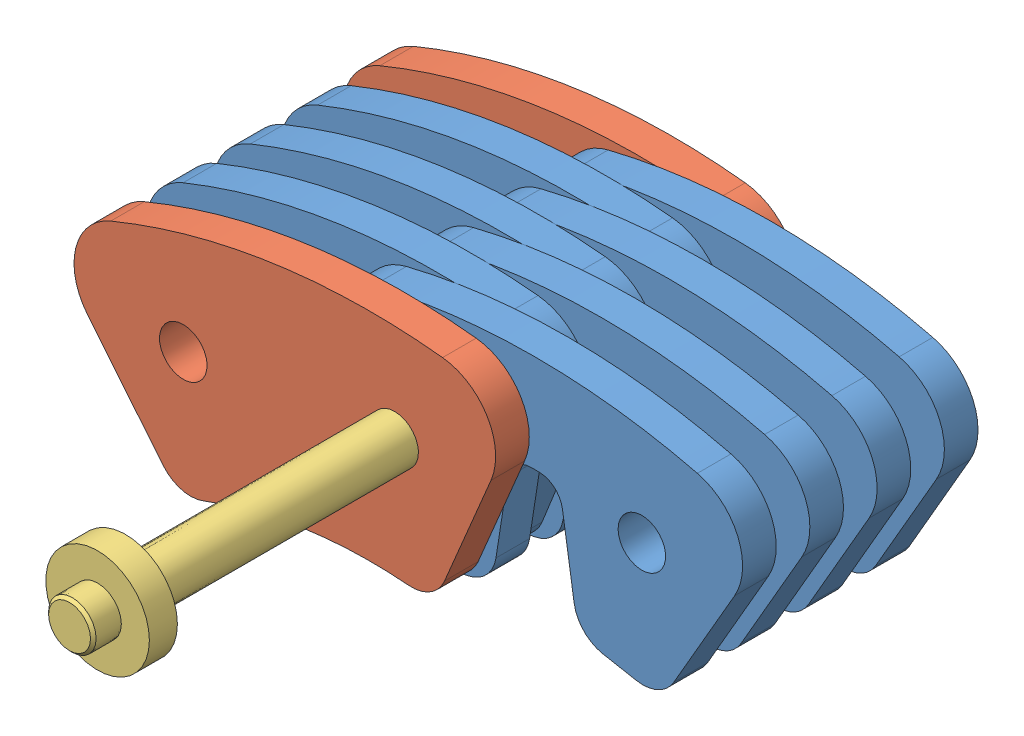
SolidWorks assembly ChainCASM_Out.SLDASM, configuration CL06-1 (file format 4400). Lengths in mm.
Overall size (28.79 12.83 30.5).
10 component instances, 3 part files, 9 mates.
Components (placement in the parent):
- ChainC_LJ-1: ChainC_LJ.SLDPRT [CL06-1] at (-6.8971 -55.1663 0) size (18.51 10.27 1.5)
- ChainC_LJ-2: ChainC_LJ.SLDPRT [CL06-1] at (-6.8971 -55.1663 3) size (18.51 10.27 1.5)
- ChainC_LJ-3: ChainC_LJ.SLDPRT [CL06-1] at (-6.8971 -55.1663 6) size (18.51 10.27 1.5)
- ChainC_LJ-4: ChainC_LJ.SLDPRT [CL06-1] at (-6.8971 -55.1663 9) size (18.51 10.27 1.5)
- ChainC_LJ-5: ChainC_LJ.SLDPRT [CL06-1] at (-12.7498 -55.5846 1.5) x (0.989832 0.142241 0) z (0 0 1) size (18.51 10.27 1.5)
- ChainC_LJ-6: ChainC_LJ.SLDPRT [CL06-1] at (-12.7498 -55.5846 4.5) x (0.989832 0.142241 0) z (0 0 1) size (18.51 10.27 1.5)
- ChainC_LJ-7: ChainC_LJ.SLDPRT [CL06-1] at (-12.7498 -55.5846 7.5) x (0.989832 0.142241 0) z (0 0 1) size (18.51 10.27 1.5)
- ChainC_DB-1: ChainC_DB.SLDPRT [CL06-1] at (-12.7498 -55.5846 -1.5) x (0.989832 0.142241 0) z (0 0 1) size (18.94 10.22 1.5)
- ChainC_DB-2: ChainC_DB.SLDPRT [CL06-1] at (-12.7498 -55.5846 10.5) x (0.989832 0.142241 0) z (0 0 1) size (18.94 10.22 1.5)
- ChainCL_Out-1: ChainCL_Out.SLDPRT [默认] at (-11.6596 -29.6891 10.5) size (4.62 4.62 30.5)
Mates (geometry in assembly coordinates):
- 同心1: concentric aligned: cylinder of ChainC_LJ-1 through (-11.6596 -29.6891 0.75) axis (0 0 -1) radius 1.06; cylinder of ChainC_LJ-5 through (-11.6596 -29.6891 2.25) axis (0 0 -1) radius 1.06
- 重合1: coincident anti-aligned: plane of ChainC_LJ-1 through (-6.8971 -55.1663 0.75) normal (0 0 1); plane of ChainC_LJ-5 through (-12.7498 -55.5846 0.75) normal (0 0 -1)
- 重合2: coincident anti-aligned: plane of ChainC_LJ-1 through (-6.8971 -55.1663 -0.75) normal (0 0 -1); plane of ChainC_DB-1 through (-12.7498 -55.5846 -0.75) normal (0 0 1)
- 同心3: concentric aligned: cylinder of ChainC_LJ-1 through (-11.6596 -29.6891 0.75) axis (0 0 -1) radius 1.06; cylinder of ChainC_DB-1 through (-11.6596 -29.6891 -0.75) axis (0 0 -1) radius 1.06
- 同心4: concentric aligned: cylinder of ChainC_LJ-5 through (-21.0877 -31.044 2.25) axis (0 0 -1) radius 1.06; cylinder of ChainC_DB-1 through (-21.0877 -31.044 -0.75) axis (0 0 -1) radius 1.06
- 同心5: concentric anti-aligned: cylinder of ChainC_DB-1 through (-11.6596 -29.6891 -0.75) axis (0 0 -1) radius 1.06; cylinder of ChainCL_Out-1 through (-11.6596 -29.6891 25.75) axis (0 0 1) radius 1.06
- 重合6: coincident anti-aligned: plane of ChainC_DB-1 through (-12.7498 -55.5846 -2.25) normal (0 0 -1); plane of ChainCL_Out-1 through (-11.6596 -27.3791 -2.25) normal (0 0 1)
- 局部线性阵列2: unknown: line of ChainC_LJ-5 through (-9.7659 -25.4549 2.25) axis (0 0 -1)
- 局部线性阵列3: unknown = 3.4931 mm: line of ChainC_DB-1 through (-9.5232 -25.4799 -0.75) axis (0 0 -1)
